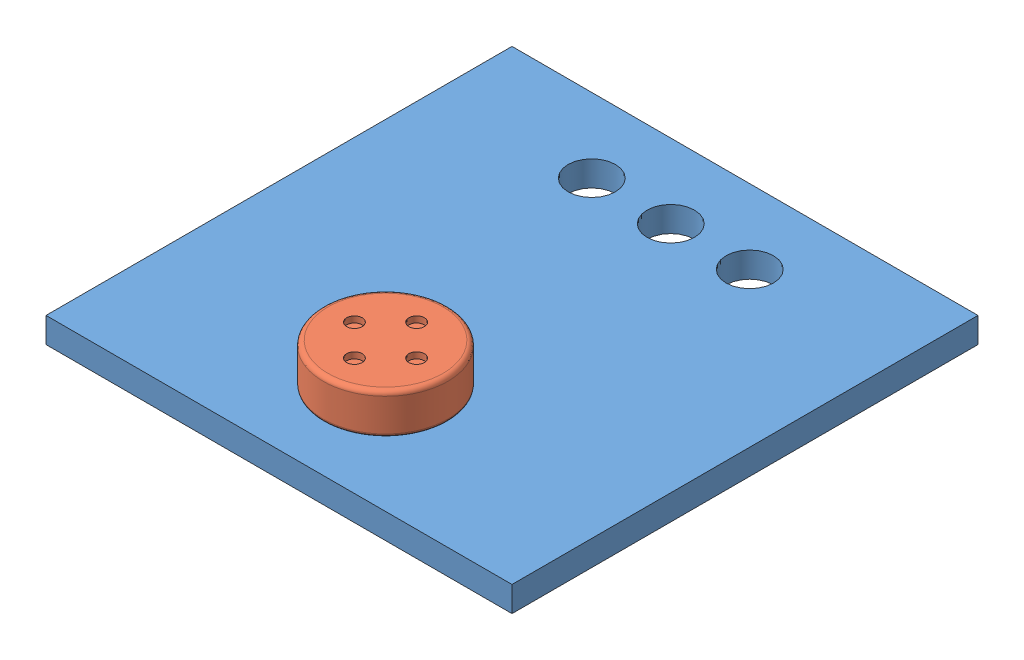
SolidWorks assembly Mic4013onBoard.SLDASM, configuration Default (file format 12000). Lengths in mm.
Overall size (14.99 2.16 14.99).
2 component instances, 2 part files, 2 mates.
Components (placement in the parent):
- mic_board-1: mic_board.SLDPRT [Default] at (-0.7908 -0.2923 14.986) size (14.99 0.81 14.99)
- CUI_DEVICES_CMC-4013-SMT-TR-1: CUI_DEVICES_CMC-4013-SMT-TR.sldprt [Default] at (-0.7857 0.5705 19.0583) x (0 1 0) z (0 0 1) size (1.35 4 4)
Mates (geometry in assembly coordinates):
- Coincident1: coincident: plane of mic_board-1 through (-0.7908 0.5205 14.986) normal (0 1 0); plane of CUI_DEVICES_CMC-4013-SMT-TR-1 through (-0.9989 0.5205 18.8447) normal (0 -1 0)
- Parallel1: parallel aligned: plane of mic_board-1 through (-0.7908 -0.2923 14.986) normal (0 -1 0); plane of CUI_DEVICES_CMC-4013-SMT-TR-1 through (-0.9989 0.5205 18.8447) normal (0 -1 0)
